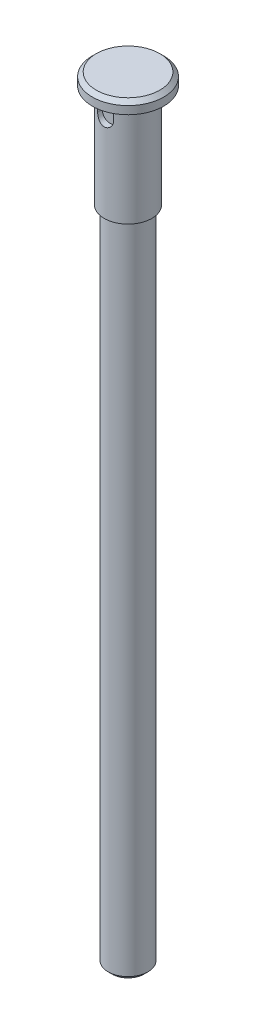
from build123d import *

# Parameters (mm, degrees)
ENL_V_MAT_EXTRU_1_DEPTH = 3.5


with BuildPart() as part:
    # Esquisse1 → Base-R_volution (revolve)
    with BuildSketch(Plane.XY, mode=Mode.PRIVATE) as base_r_volution_sk:
        Polygon((0, 0), (-4, 0), (-5, 1), (-5, 166), (-6, 166), (-6, 192), (-9, 192), (-9, 194), (-8, 195), (0, 195), align=None)
    revolve(base_r_volution_sk.sketch.rotate(Axis((0, 0, 0), (0, 1, 0)), 270), axis=Axis((0, 0, 0), (0, 1, 0)))

    # Esquisse2 → Enl_v. mat.-Extru.1 (cut)
    with BuildSketch(Plane.XY.offset(8)):
        with BuildLine():
            Line((-2, 190), (-2, 188))
            ThreePointArc((-2, 188), (0, 186), (2, 188))
            Line((2, 188), (2, 190))
            ThreePointArc((2, 190), (0, 192), (-2, 190))
        make_face()
    extrude(amount=-ENL_V_MAT_EXTRU_1_DEPTH, mode=Mode.SUBTRACT)


solid = part.part
